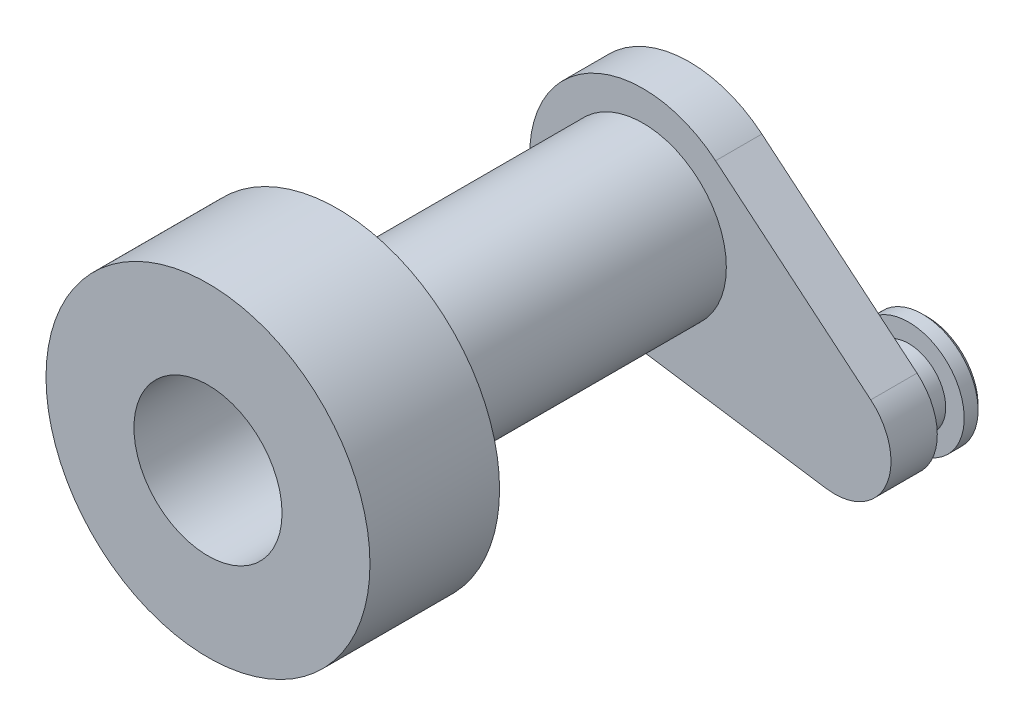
ISO-10303-21;
HEADER;
FILE_DESCRIPTION(('STEP AP214'),'2;1');
FILE_NAME('part.step','',(''),(''),'','','');
FILE_SCHEMA(('AUTOMOTIVE_DESIGN { 1 0 10303 214 1 1 1 1 }'));
ENDSEC;
DATA;
#1=APPLICATION_CONTEXT('core data for automotive mechanical design processes');
#2=APPLICATION_PROTOCOL_DEFINITION('international standard','automotive_design',2000,#1);
#3=PRODUCT_CONTEXT('',#1,'mechanical');
#4=PRODUCT('Part','Part','',(#3));
#5=PRODUCT_RELATED_PRODUCT_CATEGORY('part','',(#4));
#6=PRODUCT_DEFINITION_FORMATION('','',#4);
#7=PRODUCT_DEFINITION_CONTEXT('part definition',#1,'design');
#8=PRODUCT_DEFINITION('design','',#6,#7);
#9=PRODUCT_DEFINITION_SHAPE('','',#8);
#10=(LENGTH_UNIT() NAMED_UNIT(*) SI_UNIT(.MILLI.,.METRE.));
#11=(NAMED_UNIT(*) PLANE_ANGLE_UNIT() SI_UNIT($,.RADIAN.));
#12=(NAMED_UNIT(*) SI_UNIT($,.STERADIAN.) SOLID_ANGLE_UNIT());
#13=UNCERTAINTY_MEASURE_WITH_UNIT(LENGTH_MEASURE(1.E-05),#10,'distance_accuracy_value','');
#14=(GEOMETRIC_REPRESENTATION_CONTEXT(3) GLOBAL_UNCERTAINTY_ASSIGNED_CONTEXT((#13)) GLOBAL_UNIT_ASSIGNED_CONTEXT((#10,
#11,#12)) REPRESENTATION_CONTEXT('',''));
#15=CARTESIAN_POINT('',(0.,0.,0.));
#16=DIRECTION('',(0.,0.,1.));
#17=DIRECTION('',(1.,0.,0.));
#18=AXIS2_PLACEMENT_3D('',#15,#16,#17);
#19=CARTESIAN_POINT('',(353.595340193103,142.140968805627,-52.));
#20=DIRECTION('',(0.,0.,-1.));
#21=DIRECTION('',(-1.,0.,0.));
#22=AXIS2_PLACEMENT_3D('',#19,#20,#21);
#23=PLANE('',#22);
#24=CARTESIAN_POINT('',(374.294287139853,132.870801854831,-52.0000000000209));
#25=DIRECTION('',(0.,0.,-1.));
#26=DIRECTION('',(-1.,0.,0.));
#27=AXIS2_PLACEMENT_3D('',#24,#25,#26);
#28=CIRCLE('',#27,6.09089443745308);
#29=CARTESIAN_POINT('',(378.196754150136,137.547311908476,-52.0000000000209));
#30=VERTEX_POINT('',#29);
#31=CARTESIAN_POINT('',(373.4038073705,126.845352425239,-52.0000000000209));
#32=VERTEX_POINT('',#31);
#33=EDGE_CURVE('E78',#30,#32,#28,.T.);
#34=ORIENTED_EDGE('',*,*,#33,.T.);
#35=DIRECTION('',(-0.989255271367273,0.14619852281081,0.));
#36=VECTOR('',#35,1.);
#37=CARTESIAN_POINT('',(373.4038073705,126.845352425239,-52.0000000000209));
#38=LINE('',#37,#36);
#39=CARTESIAN_POINT('',(351.806557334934,130.037133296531,-52.0000000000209));
#40=VERTEX_POINT('',#39);
#41=EDGE_CURVE('E88',#32,#40,#38,.T.);
#42=ORIENTED_EDGE('',*,*,#41,.T.);
#43=CARTESIAN_POINT('',(353.595340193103,142.140968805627,-52.0000000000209));
#44=DIRECTION('',(0.,0.,-1.));
#45=DIRECTION('',(-1.,0.,0.));
#46=AXIS2_PLACEMENT_3D('',#43,#44,#45);
#47=CIRCLE('',#46,12.2353004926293);
#48=CARTESIAN_POINT('',(361.434559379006,151.535074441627,-52.0000000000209));
#49=VERTEX_POINT('',#48);
#50=EDGE_CURVE('E93',#40,#49,#47,.T.);
#51=ORIENTED_EDGE('',*,*,#50,.T.);
#52=DIRECTION('',(0.767787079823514,-0.640705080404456,0.));
#53=VECTOR('',#52,1.);
#54=CARTESIAN_POINT('',(378.196754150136,137.547311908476,-52.0000000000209));
#55=LINE('',#54,#53);
#56=EDGE_CURVE('E96',#49,#30,#55,.T.);
#57=ORIENTED_EDGE('',*,*,#56,.T.);
#58=EDGE_LOOP('',(#34,#42,#51,#57));
#59=FACE_BOUND('',#58,.T.);
#60=CARTESIAN_POINT('',(353.595340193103,142.140968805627,-52.0000000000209));
#61=DIRECTION('',(0.,0.,-1.));
#62=DIRECTION('',(-1.,0.,0.));
#63=AXIS2_PLACEMENT_3D('',#60,#61,#62);
#64=CIRCLE('',#63,7.62697401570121);
#65=CARTESIAN_POINT('',(345.968366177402,142.140968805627,-52.0000000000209));
#66=VERTEX_POINT('',#65);
#67=EDGE_CURVE('E100',#66,#66,#64,.T.);
#68=ORIENTED_EDGE('',*,*,#67,.F.);
#69=EDGE_LOOP('',(#68));
#70=FACE_BOUND('',#69,.T.);
#71=CARTESIAN_POINT('',(374.294287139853,132.870801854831,-52.));
#72=DIRECTION('',(0.,0.,-1.));
#73=DIRECTION('',(-1.,0.,0.));
#74=AXIS2_PLACEMENT_3D('',#71,#72,#73);
#75=CIRCLE('',#74,3.99999999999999);
#76=CARTESIAN_POINT('',(370.294287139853,132.870801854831,-52.));
#77=VERTEX_POINT('',#76);
#78=EDGE_CURVE('E205',#77,#77,#75,.T.);
#79=ORIENTED_EDGE('',*,*,#78,.F.);
#80=EDGE_LOOP('',(#79));
#81=FACE_BOUND('',#80,.T.);
#82=ADVANCED_FACE('F34',(#59,#70,#81),#23,.T.);
#83=CARTESIAN_POINT('',(353.595340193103,142.140968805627,-52.));
#84=DIRECTION('',(0.,0.,1.));
#85=DIRECTION('',(1.,0.,0.));
#86=AXIS2_PLACEMENT_3D('',#83,#84,#85);
#87=CYLINDRICAL_SURFACE('',#86,8.99999999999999);
#88=CARTESIAN_POINT('',(353.595340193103,142.140968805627,-14.));
#89=DIRECTION('',(0.,0.,1.));
#90=DIRECTION('',(1.,0.,0.));
#91=AXIS2_PLACEMENT_3D('',#88,#89,#90);
#92=CIRCLE('',#91,8.99999999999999);
#93=CARTESIAN_POINT('',(362.595340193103,142.140968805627,-14.));
#94=VERTEX_POINT('',#93);
#95=EDGE_CURVE('E128',#94,#94,#92,.F.);
#96=ORIENTED_EDGE('',*,*,#95,.T.);
#97=EDGE_LOOP('',(#96));
#98=FACE_BOUND('',#97,.T.);
#99=CARTESIAN_POINT('',(353.595340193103,142.140968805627,-47.0000000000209));
#100=DIRECTION('',(0.,0.,-1.));
#101=DIRECTION('',(-1.,0.,0.));
#102=AXIS2_PLACEMENT_3D('',#99,#100,#101);
#103=CIRCLE('',#102,8.99999999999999);
#104=CARTESIAN_POINT('',(344.595340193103,142.140968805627,-47.0000000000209));
#105=VERTEX_POINT('',#104);
#106=EDGE_CURVE('E116',#105,#105,#103,.T.);
#107=ORIENTED_EDGE('',*,*,#106,.F.);
#108=EDGE_LOOP('',(#107));
#109=FACE_BOUND('',#108,.T.);
#110=ADVANCED_FACE('F149',(#98,#109),#87,.T.);
#111=CARTESIAN_POINT('',(353.595340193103,142.140968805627,-52.));
#112=DIRECTION('',(0.,0.,1.));
#113=DIRECTION('',(1.,0.,0.));
#114=AXIS2_PLACEMENT_3D('',#111,#112,#113);
#115=CYLINDRICAL_SURFACE('',#114,7.99999999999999);
#116=CARTESIAN_POINT('',(353.595340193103,142.140968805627,0.));
#117=DIRECTION('',(0.,0.,1.));
#118=DIRECTION('',(1.,0.,0.));
#119=AXIS2_PLACEMENT_3D('',#116,#117,#118);
#120=CIRCLE('',#119,7.99999999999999);
#121=CARTESIAN_POINT('',(361.595340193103,142.140968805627,0.));
#122=VERTEX_POINT('',#121);
#123=EDGE_CURVE('E113',#122,#122,#120,.T.);
#124=CARTESIAN_POINT('',(353.595340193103,142.140968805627,-47.0000000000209));
#125=DIRECTION('',(0.,0.,-1.));
#126=DIRECTION('',(-1.,0.,0.));
#127=AXIS2_PLACEMENT_3D('',#124,#125,#126);
#128=CIRCLE('',#127,7.99999999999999);
#129=CARTESIAN_POINT('',(361.595340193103,142.140968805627,-47.0000000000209));
#130=VERTEX_POINT('',#129);
#131=EDGE_CURVE('E119',#130,#130,#128,.F.);
#132=CARTESIAN_POINT('',(361.595340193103,142.140968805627,0.));
#133=CARTESIAN_POINT('',(361.595340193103,142.140968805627,-0.489583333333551));
#134=CARTESIAN_POINT('',(361.595340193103,142.140968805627,-0.979166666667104));
#135=CARTESIAN_POINT('',(361.595340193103,142.140968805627,-1.95833333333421));
#136=CARTESIAN_POINT('',(361.595340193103,142.140968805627,-2.44791666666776));
#137=CARTESIAN_POINT('',(361.595340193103,142.140968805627,-3.42708333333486));
#138=CARTESIAN_POINT('',(361.595340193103,142.140968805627,-3.91666666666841));
#139=CARTESIAN_POINT('',(361.595340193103,142.140968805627,-4.89583333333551));
#140=CARTESIAN_POINT('',(361.595340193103,142.140968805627,-5.38541666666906));
#141=CARTESIAN_POINT('',(361.595340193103,142.140968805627,-6.36458333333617));
#142=CARTESIAN_POINT('',(361.595340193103,142.140968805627,-6.85416666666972));
#143=CARTESIAN_POINT('',(361.595340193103,142.140968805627,-7.83333333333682));
#144=CARTESIAN_POINT('',(361.595340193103,142.140968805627,-8.32291666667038));
#145=CARTESIAN_POINT('',(361.595340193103,142.140968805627,-9.30208333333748));
#146=CARTESIAN_POINT('',(361.595340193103,142.140968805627,-9.79166666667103));
#147=CARTESIAN_POINT('',(361.595340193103,142.140968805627,-10.7708333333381));
#148=CARTESIAN_POINT('',(361.595340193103,142.140968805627,-11.2604166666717));
#149=CARTESIAN_POINT('',(361.595340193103,142.140968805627,-12.2395833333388));
#150=CARTESIAN_POINT('',(361.595340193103,142.140968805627,-12.7291666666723));
#151=CARTESIAN_POINT('',(361.595340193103,142.140968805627,-13.7083333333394));
#152=CARTESIAN_POINT('',(361.595340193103,142.140968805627,-14.197916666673));
#153=CARTESIAN_POINT('',(361.595340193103,142.140968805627,-15.1770833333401));
#154=CARTESIAN_POINT('',(361.595340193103,142.140968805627,-15.6666666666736));
#155=CARTESIAN_POINT('',(361.595340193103,142.140968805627,-16.6458333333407));
#156=CARTESIAN_POINT('',(361.595340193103,142.140968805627,-17.1354166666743));
#157=CARTESIAN_POINT('',(361.595340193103,142.140968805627,-18.1145833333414));
#158=CARTESIAN_POINT('',(361.595340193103,142.140968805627,-18.6041666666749));
#159=CARTESIAN_POINT('',(361.595340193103,142.140968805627,-19.5833333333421));
#160=CARTESIAN_POINT('',(361.595340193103,142.140968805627,-20.0729166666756));
#161=CARTESIAN_POINT('',(361.595340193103,142.140968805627,-21.0520833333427));
#162=CARTESIAN_POINT('',(361.595340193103,142.140968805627,-21.5416666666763));
#163=CARTESIAN_POINT('',(361.595340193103,142.140968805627,-22.5208333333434));
#164=CARTESIAN_POINT('',(361.595340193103,142.140968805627,-23.0104166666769));
#165=CARTESIAN_POINT('',(361.595340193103,142.140968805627,-23.989583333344));
#166=CARTESIAN_POINT('',(361.595340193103,142.140968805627,-24.4791666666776));
#167=CARTESIAN_POINT('',(361.595340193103,142.140968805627,-25.4583333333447));
#168=CARTESIAN_POINT('',(361.595340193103,142.140968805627,-25.9479166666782));
#169=CARTESIAN_POINT('',(361.595340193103,142.140968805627,-26.9270833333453));
#170=CARTESIAN_POINT('',(361.595340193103,142.140968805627,-27.4166666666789));
#171=CARTESIAN_POINT('',(361.595340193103,142.140968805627,-28.395833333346));
#172=CARTESIAN_POINT('',(361.595340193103,142.140968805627,-28.8854166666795));
#173=CARTESIAN_POINT('',(361.595340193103,142.140968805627,-29.8645833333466));
#174=CARTESIAN_POINT('',(361.595340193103,142.140968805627,-30.3541666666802));
#175=CARTESIAN_POINT('',(361.595340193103,142.140968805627,-31.3333333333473));
#176=CARTESIAN_POINT('',(361.595340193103,142.140968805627,-31.8229166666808));
#177=CARTESIAN_POINT('',(361.595340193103,142.140968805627,-32.8020833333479));
#178=CARTESIAN_POINT('',(361.595340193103,142.140968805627,-33.2916666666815));
#179=CARTESIAN_POINT('',(361.595340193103,142.140968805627,-34.2708333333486));
#180=CARTESIAN_POINT('',(361.595340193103,142.140968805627,-34.7604166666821));
#181=CARTESIAN_POINT('',(361.595340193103,142.140968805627,-35.7395833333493));
#182=CARTESIAN_POINT('',(361.595340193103,142.140968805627,-36.2291666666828));
#183=CARTESIAN_POINT('',(361.595340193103,142.140968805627,-37.2083333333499));
#184=CARTESIAN_POINT('',(361.595340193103,142.140968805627,-37.6979166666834));
#185=CARTESIAN_POINT('',(361.595340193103,142.140968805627,-38.6770833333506));
#186=CARTESIAN_POINT('',(361.595340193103,142.140968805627,-39.1666666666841));
#187=CARTESIAN_POINT('',(361.595340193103,142.140968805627,-40.1458333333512));
#188=CARTESIAN_POINT('',(361.595340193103,142.140968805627,-40.6354166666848));
#189=CARTESIAN_POINT('',(361.595340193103,142.140968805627,-41.6145833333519));
#190=CARTESIAN_POINT('',(361.595340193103,142.140968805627,-42.1041666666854));
#191=CARTESIAN_POINT('',(361.595340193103,142.140968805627,-43.0833333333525));
#192=CARTESIAN_POINT('',(361.595340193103,142.140968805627,-43.5729166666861));
#193=CARTESIAN_POINT('',(361.595340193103,142.140968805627,-44.5520833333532));
#194=CARTESIAN_POINT('',(361.595340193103,142.140968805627,-45.0416666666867));
#195=CARTESIAN_POINT('',(361.595340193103,142.140968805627,-46.0208333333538));
#196=CARTESIAN_POINT('',(361.595340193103,142.140968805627,-46.5104166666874));
#197=CARTESIAN_POINT('',(361.595340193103,142.140968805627,-47.0000000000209));
#198=B_SPLINE_CURVE_WITH_KNOTS('',3,(#132,#133,#134,#135,#136,#137,#138,#139,#140,#141,#142,
#143,#144,#145,#146,#147,#148,#149,#150,#151,#152,#153,#154,#155,#156,#157,#158,#159,#160,#161,
#162,#163,#164,#165,#166,#167,#168,#169,#170,#171,#172,#173,#174,#175,#176,#177,#178,#179,#180,
#181,#182,#183,#184,#185,#186,#187,#188,#189,#190,#191,#192,#193,#194,#195,#196,#197),
.UNSPECIFIED.,.F.,.F.,(4,2,2,2,2,2,2,2,2,2,2,2,2,2,2,2,2,2,2,2,2,2,2,2,2,2,2,2,2,2,2,2,4),(0.,
1.46875000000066,2.93750000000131,4.40625000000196,5.87500000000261,7.34375000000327,
8.81250000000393,10.2812500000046,11.7500000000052,13.2187500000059,14.6875000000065,
16.1562500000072,17.6250000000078,19.0937500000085,20.5625000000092,22.0312500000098,
23.5000000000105,24.9687500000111,26.4375000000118,27.9062500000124,29.3750000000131,
30.8437500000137,32.3125000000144,33.781250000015,35.2500000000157,36.7187500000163,
38.187500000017,39.6562500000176,41.1250000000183,42.593750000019,44.0625000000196,
45.5312500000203,47.0000000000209),.UNSPECIFIED.);
#199=EDGE_CURVE('BSEAM154',#122,#130,#198,.T.);
#200=ORIENTED_EDGE('',*,*,#123,.T.);
#201=ORIENTED_EDGE('',*,*,#131,.F.);
#202=ORIENTED_EDGE('',*,*,#199,.T.);
#203=ORIENTED_EDGE('',*,*,#199,.F.);
#204=EDGE_LOOP('',(#200,#202,#201,#203));
#205=FACE_BOUND('',#204,.T.);
#206=ADVANCED_FACE('F154',(#205),#115,.F.);
#207=CARTESIAN_POINT('',(353.595340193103,142.140968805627,-14.));
#208=DIRECTION('',(0.,0.,1.));
#209=DIRECTION('',(1.,0.,0.));
#210=AXIS2_PLACEMENT_3D('',#207,#208,#209);
#211=PLANE('',#210);
#212=CARTESIAN_POINT('',(353.595340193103,142.140968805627,-14.));
#213=DIRECTION('',(0.,0.,1.));
#214=DIRECTION('',(1.,0.,0.));
#215=AXIS2_PLACEMENT_3D('',#212,#213,#214);
#216=CIRCLE('',#215,17.5);
#217=CARTESIAN_POINT('',(371.095340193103,142.140968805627,-14.));
#218=VERTEX_POINT('',#217);
#219=EDGE_CURVE('E125',#218,#218,#216,.T.);
#220=ORIENTED_EDGE('',*,*,#219,.F.);
#221=EDGE_LOOP('',(#220));
#222=FACE_BOUND('',#221,.T.);
#223=ORIENTED_EDGE('',*,*,#95,.F.);
#224=EDGE_LOOP('',(#223));
#225=FACE_BOUND('',#224,.T.);
#226=ADVANCED_FACE('F164',(#222,#225),#211,.F.);
#227=CARTESIAN_POINT('',(353.595340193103,142.140968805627,-14.));
#228=DIRECTION('',(0.,0.,1.));
#229=DIRECTION('',(1.,0.,0.));
#230=AXIS2_PLACEMENT_3D('',#227,#228,#229);
#231=CYLINDRICAL_SURFACE('',#230,17.5);
#232=ORIENTED_EDGE('',*,*,#219,.T.);
#233=EDGE_LOOP('',(#232));
#234=FACE_BOUND('',#233,.T.);
#235=CARTESIAN_POINT('',(353.595340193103,142.140968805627,0.));
#236=DIRECTION('',(0.,0.,1.));
#237=DIRECTION('',(1.,0.,0.));
#238=AXIS2_PLACEMENT_3D('',#235,#236,#237);
#239=CIRCLE('',#238,17.5);
#240=CARTESIAN_POINT('',(371.095340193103,142.140968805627,0.));
#241=VERTEX_POINT('',#240);
#242=EDGE_CURVE('E122',#241,#241,#239,.T.);
#243=ORIENTED_EDGE('',*,*,#242,.F.);
#244=EDGE_LOOP('',(#243));
#245=FACE_BOUND('',#244,.T.);
#246=ADVANCED_FACE('F36',(#234,#245),#231,.T.);
#247=CARTESIAN_POINT('',(353.595340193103,142.140968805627,0.));
#248=DIRECTION('',(0.,0.,1.));
#249=DIRECTION('',(1.,0.,0.));
#250=AXIS2_PLACEMENT_3D('',#247,#248,#249);
#251=PLANE('',#250);
#252=ORIENTED_EDGE('',*,*,#123,.F.);
#253=EDGE_LOOP('',(#252));
#254=FACE_BOUND('',#253,.T.);
#255=ORIENTED_EDGE('',*,*,#242,.T.);
#256=EDGE_LOOP('',(#255));
#257=FACE_BOUND('',#256,.T.);
#258=ADVANCED_FACE('F160',(#254,#257),#251,.T.);
#259=CARTESIAN_POINT('',(374.294287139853,132.870801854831,-47.0000000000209));
#260=DIRECTION('',(0.,0.,-1.));
#261=DIRECTION('',(-1.,0.,0.));
#262=AXIS2_PLACEMENT_3D('',#259,#260,#261);
#263=PLANE('',#262);
#264=CARTESIAN_POINT('',(353.595340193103,142.140968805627,-47.0000000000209));
#265=DIRECTION('',(0.,0.,-1.));
#266=DIRECTION('',(-1.,0.,0.));
#267=AXIS2_PLACEMENT_3D('',#264,#265,#266);
#268=CIRCLE('',#267,7.62697401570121);
#269=CARTESIAN_POINT('',(345.968366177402,142.140968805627,-47.0000000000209));
#270=VERTEX_POINT('',#269);
#271=EDGE_CURVE('E97',#270,#270,#268,.T.);
#272=ORIENTED_EDGE('',*,*,#271,.T.);
#273=EDGE_LOOP('',(#272));
#274=FACE_BOUND('',#273,.T.);
#275=ORIENTED_EDGE('',*,*,#131,.T.);
#276=EDGE_LOOP('',(#275));
#277=FACE_BOUND('',#276,.T.);
#278=ADVANCED_FACE('F162',(#274,#277),#263,.F.);
#279=CARTESIAN_POINT('',(353.595340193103,142.140968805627,-47.0000000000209));
#280=DIRECTION('',(0.,0.,-1.));
#281=DIRECTION('',(-1.,0.,0.));
#282=AXIS2_PLACEMENT_3D('',#279,#280,#281);
#283=CYLINDRICAL_SURFACE('',#282,7.62697401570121);
#284=ORIENTED_EDGE('',*,*,#271,.F.);
#285=EDGE_LOOP('',(#284));
#286=FACE_BOUND('',#285,.T.);
#287=ORIENTED_EDGE('',*,*,#67,.T.);
#288=EDGE_LOOP('',(#287));
#289=FACE_BOUND('',#288,.T.);
#290=ADVANCED_FACE('F181',(#286,#289),#283,.F.);
#291=CARTESIAN_POINT('',(374.294287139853,132.870801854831,-47.0000000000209));
#292=DIRECTION('',(0.,0.,-1.));
#293=DIRECTION('',(-1.,0.,0.));
#294=AXIS2_PLACEMENT_3D('',#291,#292,#293);
#295=CIRCLE('',#294,6.09089443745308);
#296=CARTESIAN_POINT('',(378.196754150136,137.547311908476,-47.0000000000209));
#297=VERTEX_POINT('',#296);
#298=CARTESIAN_POINT('',(373.4038073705,126.845352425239,-47.0000000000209));
#299=VERTEX_POINT('',#298);
#300=EDGE_CURVE('E80',#297,#299,#295,.T.);
#301=ORIENTED_EDGE('',*,*,#300,.F.);
#302=DIRECTION('',(0.767787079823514,-0.640705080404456,0.));
#303=VECTOR('',#302,1.);
#304=CARTESIAN_POINT('',(378.196754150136,137.547311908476,-47.0000000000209));
#305=LINE('',#304,#303);
#306=CARTESIAN_POINT('',(361.434559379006,151.535074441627,-47.0000000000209));
#307=VERTEX_POINT('',#306);
#308=EDGE_CURVE('E85',#307,#297,#305,.T.);
#309=ORIENTED_EDGE('',*,*,#308,.F.);
#310=CARTESIAN_POINT('',(353.595340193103,142.140968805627,-47.0000000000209));
#311=DIRECTION('',(0.,0.,-1.));
#312=DIRECTION('',(-1.,0.,0.));
#313=AXIS2_PLACEMENT_3D('',#310,#311,#312);
#314=CIRCLE('',#313,12.2353004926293);
#315=CARTESIAN_POINT('',(351.806557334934,130.037133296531,-47.0000000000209));
#316=VERTEX_POINT('',#315);
#317=EDGE_CURVE('E109',#316,#307,#314,.T.);
#318=ORIENTED_EDGE('',*,*,#317,.F.);
#319=DIRECTION('',(-0.989255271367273,0.14619852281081,0.));
#320=VECTOR('',#319,1.);
#321=CARTESIAN_POINT('',(373.4038073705,126.845352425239,-47.0000000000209));
#322=LINE('',#321,#320);
#323=EDGE_CURVE('E107',#299,#316,#322,.T.);
#324=ORIENTED_EDGE('',*,*,#323,.F.);
#325=EDGE_LOOP('',(#301,#309,#318,#324));
#326=FACE_BOUND('',#325,.T.);
#327=ORIENTED_EDGE('',*,*,#106,.T.);
#328=EDGE_LOOP('',(#327));
#329=FACE_BOUND('',#328,.T.);
#330=ADVANCED_FACE('F179',(#326,#329),#263,.F.);
#331=CARTESIAN_POINT('',(374.294287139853,132.870801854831,-47.0000000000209));
#332=DIRECTION('',(0.,0.,-1.));
#333=DIRECTION('',(-1.,0.,0.));
#334=AXIS2_PLACEMENT_3D('',#331,#332,#333);
#335=CYLINDRICAL_SURFACE('',#334,6.09089443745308);
#336=ORIENTED_EDGE('',*,*,#33,.F.);
#337=DIRECTION('',(0.,0.,-1.));
#338=VECTOR('',#337,1.);
#339=CARTESIAN_POINT('',(378.196754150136,137.547311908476,-47.0000000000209));
#340=LINE('',#339,#338);
#341=EDGE_CURVE('E49',#297,#30,#340,.T.);
#342=ORIENTED_EDGE('',*,*,#341,.F.);
#343=ORIENTED_EDGE('',*,*,#300,.T.);
#344=DIRECTION('',(0.,0.,-1.));
#345=VECTOR('',#344,1.);
#346=CARTESIAN_POINT('',(373.4038073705,126.845352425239,-47.0000000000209));
#347=LINE('',#346,#345);
#348=EDGE_CURVE('E74',#299,#32,#347,.T.);
#349=ORIENTED_EDGE('',*,*,#348,.T.);
#350=EDGE_LOOP('',(#336,#342,#343,#349));
#351=FACE_BOUND('',#350,.T.);
#352=ADVANCED_FACE('F76',(#351),#335,.T.);
#353=CARTESIAN_POINT('',(378.196754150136,137.547311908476,-47.0000000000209));
#354=DIRECTION('',(0.640705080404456,0.767787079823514,0.));
#355=DIRECTION('',(-0.767787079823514,0.640705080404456,0.));
#356=AXIS2_PLACEMENT_3D('',#353,#354,#355);
#357=PLANE('',#356);
#358=ORIENTED_EDGE('',*,*,#56,.F.);
#359=DIRECTION('',(0.,0.,-1.));
#360=VECTOR('',#359,1.);
#361=CARTESIAN_POINT('',(361.434559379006,151.535074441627,-47.0000000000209));
#362=LINE('',#361,#360);
#363=EDGE_CURVE('E57',#307,#49,#362,.T.);
#364=ORIENTED_EDGE('',*,*,#363,.F.);
#365=ORIENTED_EDGE('',*,*,#308,.T.);
#366=ORIENTED_EDGE('',*,*,#341,.T.);
#367=EDGE_LOOP('',(#358,#364,#365,#366));
#368=FACE_BOUND('',#367,.T.);
#369=ADVANCED_FACE('F188',(#368),#357,.T.);
#370=CARTESIAN_POINT('',(353.595340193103,142.140968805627,-47.0000000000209));
#371=DIRECTION('',(0.,0.,-1.));
#372=DIRECTION('',(-1.,0.,0.));
#373=AXIS2_PLACEMENT_3D('',#370,#371,#372);
#374=CYLINDRICAL_SURFACE('',#373,12.2353004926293);
#375=ORIENTED_EDGE('',*,*,#50,.F.);
#376=DIRECTION('',(0.,0.,-1.));
#377=VECTOR('',#376,1.);
#378=CARTESIAN_POINT('',(351.806557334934,130.037133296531,-47.0000000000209));
#379=LINE('',#378,#377);
#380=EDGE_CURVE('E84',#316,#40,#379,.T.);
#381=ORIENTED_EDGE('',*,*,#380,.F.);
#382=ORIENTED_EDGE('',*,*,#317,.T.);
#383=ORIENTED_EDGE('',*,*,#363,.T.);
#384=EDGE_LOOP('',(#375,#381,#382,#383));
#385=FACE_BOUND('',#384,.T.);
#386=ADVANCED_FACE('F229',(#385),#374,.T.);
#387=CARTESIAN_POINT('',(373.4038073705,126.845352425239,-47.0000000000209));
#388=DIRECTION('',(-0.14619852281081,-0.989255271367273,0.));
#389=DIRECTION('',(0.989255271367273,-0.14619852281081,0.));
#390=AXIS2_PLACEMENT_3D('',#387,#388,#389);
#391=PLANE('',#390);
#392=ORIENTED_EDGE('',*,*,#41,.F.);
#393=ORIENTED_EDGE('',*,*,#348,.F.);
#394=ORIENTED_EDGE('',*,*,#323,.T.);
#395=ORIENTED_EDGE('',*,*,#380,.T.);
#396=EDGE_LOOP('',(#392,#393,#394,#395));
#397=FACE_BOUND('',#396,.T.);
#398=ADVANCED_FACE('F89',(#397),#391,.T.);
#399=CARTESIAN_POINT('',(374.294287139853,132.870801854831,-55.));
#400=DIRECTION('',(0.,0.,1.));
#401=DIRECTION('',(1.,0.,0.));
#402=AXIS2_PLACEMENT_3D('',#399,#400,#401);
#403=CYLINDRICAL_SURFACE('',#402,3.99999999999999);
#404=CARTESIAN_POINT('',(374.294287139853,132.870801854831,-55.));
#405=DIRECTION('',(0.,0.,-1.));
#406=DIRECTION('',(-1.,0.,0.));
#407=AXIS2_PLACEMENT_3D('',#404,#405,#406);
#408=CIRCLE('',#407,3.99999999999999);
#409=CARTESIAN_POINT('',(370.294287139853,132.870801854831,-55.));
#410=VERTEX_POINT('',#409);
#411=EDGE_CURVE('E203',#410,#410,#408,.T.);
#412=ORIENTED_EDGE('',*,*,#411,.F.);
#413=EDGE_LOOP('',(#412));
#414=FACE_BOUND('',#413,.T.);
#415=ORIENTED_EDGE('',*,*,#78,.T.);
#416=EDGE_LOOP('',(#415));
#417=FACE_BOUND('',#416,.T.);
#418=ADVANCED_FACE('F218',(#414,#417),#403,.T.);
#419=CARTESIAN_POINT('',(374.294287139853,132.870801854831,-55.));
#420=DIRECTION('',(0.,0.,-1.));
#421=DIRECTION('',(-1.,0.,0.));
#422=AXIS2_PLACEMENT_3D('',#419,#420,#421);
#423=PLANE('',#422);
#424=CARTESIAN_POINT('',(374.294287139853,132.870801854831,-55.));
#425=DIRECTION('',(0.,0.,-1.));
#426=DIRECTION('',(-1.,0.,0.));
#427=AXIS2_PLACEMENT_3D('',#424,#425,#426);
#428=CIRCLE('',#427,5.99999999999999);
#429=CARTESIAN_POINT('',(368.294287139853,132.870801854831,-55.));
#430=VERTEX_POINT('',#429);
#431=EDGE_CURVE('E210',#430,#430,#428,.T.);
#432=ORIENTED_EDGE('',*,*,#431,.F.);
#433=EDGE_LOOP('',(#432));
#434=FACE_BOUND('',#433,.T.);
#435=ORIENTED_EDGE('',*,*,#411,.T.);
#436=EDGE_LOOP('',(#435));
#437=FACE_BOUND('',#436,.T.);
#438=ADVANCED_FACE('F215',(#434,#437),#423,.F.);
#439=CARTESIAN_POINT('',(374.294287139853,132.870801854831,-57.));
#440=DIRECTION('',(0.,0.,1.));
#441=DIRECTION('',(1.,0.,0.));
#442=AXIS2_PLACEMENT_3D('',#439,#440,#441);
#443=CYLINDRICAL_SURFACE('',#442,5.99999999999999);
#444=CARTESIAN_POINT('',(374.294287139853,132.870801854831,-56.5));
#445=DIRECTION('',(0.,0.,-1.));
#446=DIRECTION('',(-1.,0.,0.));
#447=AXIS2_PLACEMENT_3D('',#444,#445,#446);
#448=CIRCLE('',#447,5.99999999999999);
#449=CARTESIAN_POINT('',(368.294287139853,132.870801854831,-56.5));
#450=VERTEX_POINT('',#449);
#451=EDGE_CURVE('E11',#450,#450,#448,.F.);
#452=ORIENTED_EDGE('',*,*,#451,.T.);
#453=EDGE_LOOP('',(#452));
#454=FACE_BOUND('',#453,.T.);
#455=ORIENTED_EDGE('',*,*,#431,.T.);
#456=EDGE_LOOP('',(#455));
#457=FACE_BOUND('',#456,.T.);
#458=ADVANCED_FACE('F144',(#454,#457),#443,.T.);
#459=CARTESIAN_POINT('',(374.294287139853,132.870801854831,-57.));
#460=DIRECTION('',(0.,0.,-1.));
#461=DIRECTION('',(-1.,0.,0.));
#462=AXIS2_PLACEMENT_3D('',#459,#460,#461);
#463=PLANE('',#462);
#464=CARTESIAN_POINT('',(374.294287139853,132.870801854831,-57.));
#465=DIRECTION('',(0.,0.,-1.));
#466=DIRECTION('',(-1.,0.,0.));
#467=AXIS2_PLACEMENT_3D('',#464,#465,#466);
#468=CIRCLE('',#467,5.50000000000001);
#469=CARTESIAN_POINT('',(368.794287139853,132.870801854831,-57.));
#470=VERTEX_POINT('',#469);
#471=EDGE_CURVE('E42',#470,#470,#468,.T.);
#472=ORIENTED_EDGE('',*,*,#471,.T.);
#473=EDGE_LOOP('',(#472));
#474=FACE_BOUND('',#473,.T.);
#475=ADVANCED_FACE('F135',(#474),#463,.T.);
#476=CARTESIAN_POINT('',(374.294287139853,132.870801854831,-57.));
#477=DIRECTION('',(0.,0.,1.));
#478=DIRECTION('',(1.,0.,0.));
#479=AXIS2_PLACEMENT_3D('',#476,#477,#478);
#480=CONICAL_SURFACE('',#479,5.50000000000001,0.785398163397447);
#481=ORIENTED_EDGE('',*,*,#451,.F.);
#482=EDGE_LOOP('',(#481));
#483=FACE_BOUND('',#482,.T.);
#484=ORIENTED_EDGE('',*,*,#471,.F.);
#485=EDGE_LOOP('',(#484));
#486=FACE_BOUND('',#485,.T.);
#487=ADVANCED_FACE('F137',(#483,#486),#480,.T.);
#488=CLOSED_SHELL('',(#82,#110,#206,#226,#246,#258,#278,#290,#330,#352,#369,#386,#398,#418,#438,
#458,#475,#487));
#489=MANIFOLD_SOLID_BREP('B2',#488);
#490=ADVANCED_BREP_SHAPE_REPRESENTATION('',(#18,#489),#14);
#491=SHAPE_DEFINITION_REPRESENTATION(#9,#490);
ENDSEC;
END-ISO-10303-21;
